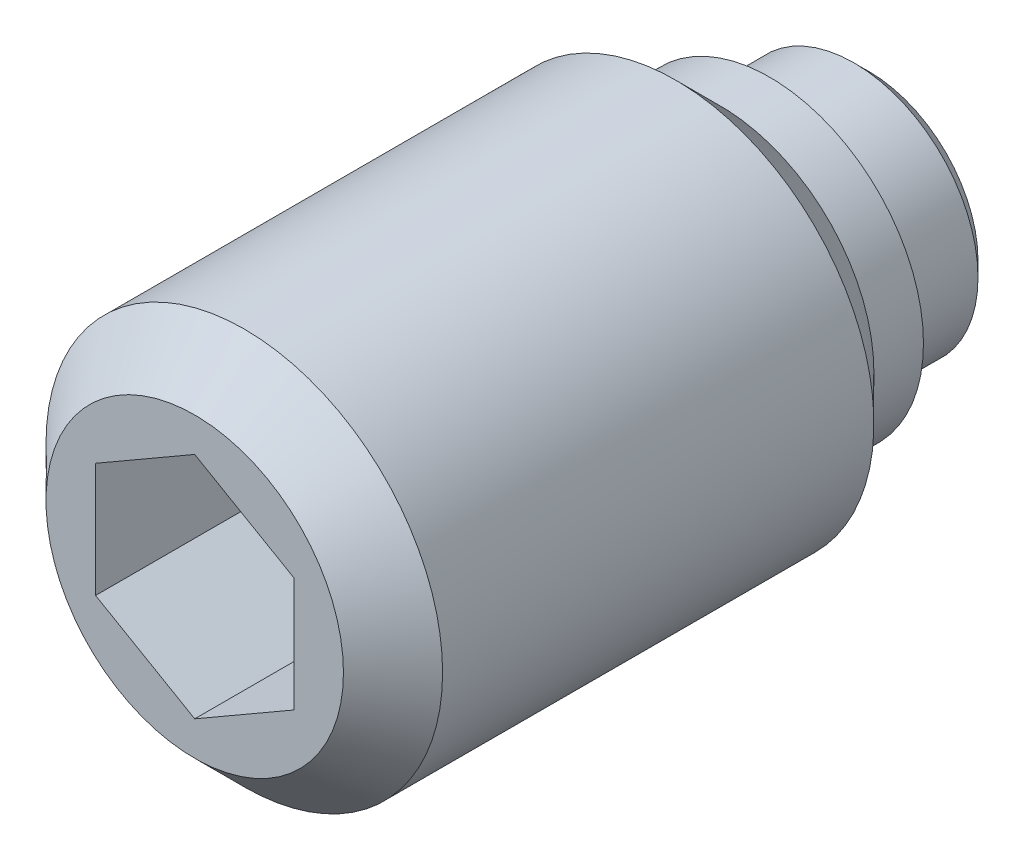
ISO-10303-21;
HEADER;
FILE_DESCRIPTION(('STEP AP214'),'2;1');
FILE_NAME('part.step','',(''),(''),'','','');
FILE_SCHEMA(('AUTOMOTIVE_DESIGN { 1 0 10303 214 1 1 1 1 }'));
ENDSEC;
DATA;
#1=APPLICATION_CONTEXT('core data for automotive mechanical design processes');
#2=APPLICATION_PROTOCOL_DEFINITION('international standard','automotive_design',2000,#1);
#3=PRODUCT_CONTEXT('',#1,'mechanical');
#4=PRODUCT('Part','Part','',(#3));
#5=PRODUCT_RELATED_PRODUCT_CATEGORY('part','',(#4));
#6=PRODUCT_DEFINITION_FORMATION('','',#4);
#7=PRODUCT_DEFINITION_CONTEXT('part definition',#1,'design');
#8=PRODUCT_DEFINITION('design','',#6,#7);
#9=PRODUCT_DEFINITION_SHAPE('','',#8);
#10=(LENGTH_UNIT() NAMED_UNIT(*) SI_UNIT(.MILLI.,.METRE.));
#11=(NAMED_UNIT(*) PLANE_ANGLE_UNIT() SI_UNIT($,.RADIAN.));
#12=(NAMED_UNIT(*) SI_UNIT($,.STERADIAN.) SOLID_ANGLE_UNIT());
#13=UNCERTAINTY_MEASURE_WITH_UNIT(LENGTH_MEASURE(1.E-05),#10,'distance_accuracy_value','');
#14=(GEOMETRIC_REPRESENTATION_CONTEXT(3) GLOBAL_UNCERTAINTY_ASSIGNED_CONTEXT((#13)) GLOBAL_UNIT_ASSIGNED_CONTEXT((#10,
#11,#12)) REPRESENTATION_CONTEXT('',''));
#15=CARTESIAN_POINT('',(0.,0.,0.));
#16=DIRECTION('',(0.,0.,1.));
#17=DIRECTION('',(1.,0.,0.));
#18=AXIS2_PLACEMENT_3D('',#15,#16,#17);
#19=CARTESIAN_POINT('',(0.,0.,0.));
#20=DIRECTION('',(0.,0.,-1.));
#21=DIRECTION('',(-1.,0.,0.));
#22=AXIS2_PLACEMENT_3D('',#19,#20,#21);
#23=CYLINDRICAL_SURFACE('',#22,2.5);
#24=CARTESIAN_POINT('',(0.,0.,0.3));
#25=DIRECTION('',(0.,0.,-1.));
#26=DIRECTION('',(-1.,0.,0.));
#27=AXIS2_PLACEMENT_3D('',#24,#25,#26);
#28=CIRCLE('',#27,2.5);
#29=CARTESIAN_POINT('',(-2.5,0.,0.3));
#30=VERTEX_POINT('',#29);
#31=EDGE_CURVE('E133',#30,#30,#28,.T.);
#32=ORIENTED_EDGE('',*,*,#31,.F.);
#33=EDGE_LOOP('',(#32));
#34=FACE_BOUND('',#33,.T.);
#35=CARTESIAN_POINT('',(0.,0.,2.));
#36=DIRECTION('',(0.,0.,-1.));
#37=DIRECTION('',(-1.,0.,0.));
#38=AXIS2_PLACEMENT_3D('',#35,#36,#37);
#39=CIRCLE('',#38,2.5);
#40=CARTESIAN_POINT('',(-2.5,0.,2.));
#41=VERTEX_POINT('',#40);
#42=EDGE_CURVE('E127',#41,#41,#39,.T.);
#43=ORIENTED_EDGE('',*,*,#42,.T.);
#44=EDGE_LOOP('',(#43));
#45=FACE_BOUND('',#44,.T.);
#46=ADVANCED_FACE('F14',(#34,#45),#23,.T.);
#47=CARTESIAN_POINT('',(0.,0.,0.3));
#48=DIRECTION('',(0.,0.,1.));
#49=DIRECTION('',(1.,0.,0.));
#50=AXIS2_PLACEMENT_3D('',#47,#48,#49);
#51=CONICAL_SURFACE('',#50,2.5,0.785398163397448);
#52=CARTESIAN_POINT('',(0.,0.,0.));
#53=DIRECTION('',(0.,0.,-1.));
#54=DIRECTION('',(-1.,0.,0.));
#55=AXIS2_PLACEMENT_3D('',#52,#53,#54);
#56=CIRCLE('',#55,2.2);
#57=CARTESIAN_POINT('',(-2.2,0.,0.));
#58=VERTEX_POINT('',#57);
#59=EDGE_CURVE('E130',#58,#58,#56,.T.);
#60=ORIENTED_EDGE('',*,*,#59,.F.);
#61=EDGE_LOOP('',(#60));
#62=FACE_BOUND('',#61,.T.);
#63=ORIENTED_EDGE('',*,*,#31,.T.);
#64=EDGE_LOOP('',(#63));
#65=FACE_BOUND('',#64,.T.);
#66=ADVANCED_FACE('F159',(#62,#65),#51,.T.);
#67=CARTESIAN_POINT('',(0.,2.2,0.));
#68=DIRECTION('',(0.,0.,1.));
#69=DIRECTION('',(1.,0.,0.));
#70=AXIS2_PLACEMENT_3D('',#67,#68,#69);
#71=PLANE('',#70);
#72=ORIENTED_EDGE('',*,*,#59,.T.);
#73=EDGE_LOOP('',(#72));
#74=FACE_BOUND('',#73,.T.);
#75=ADVANCED_FACE('F165',(#74),#71,.F.);
#76=CARTESIAN_POINT('',(0.,0.,2.));
#77=DIRECTION('',(0.,0.,-1.));
#78=DIRECTION('',(-1.,0.,0.));
#79=AXIS2_PLACEMENT_3D('',#76,#77,#78);
#80=CYLINDRICAL_SURFACE('',#79,4.);
#81=CARTESIAN_POINT('',(0.,0.,3.9));
#82=DIRECTION('',(0.,0.,-1.));
#83=DIRECTION('',(-1.,0.,0.));
#84=AXIS2_PLACEMENT_3D('',#81,#82,#83);
#85=CIRCLE('',#84,4.);
#86=CARTESIAN_POINT('',(-4.,0.,3.9));
#87=VERTEX_POINT('',#86);
#88=EDGE_CURVE('E9',#87,#87,#85,.T.);
#89=ORIENTED_EDGE('',*,*,#88,.F.);
#90=EDGE_LOOP('',(#89));
#91=FACE_BOUND('',#90,.T.);
#92=CARTESIAN_POINT('',(0.,0.,12.6));
#93=DIRECTION('',(0.,0.,1.));
#94=DIRECTION('',(1.,0.,0.));
#95=AXIS2_PLACEMENT_3D('',#92,#93,#94);
#96=CIRCLE('',#95,4.);
#97=CARTESIAN_POINT('',(4.,0.,12.6));
#98=VERTEX_POINT('',#97);
#99=EDGE_CURVE('E124',#98,#98,#96,.T.);
#100=ORIENTED_EDGE('',*,*,#99,.F.);
#101=EDGE_LOOP('',(#100));
#102=FACE_BOUND('',#101,.T.);
#103=ADVANCED_FACE('F16',(#91,#102),#80,.T.);
#104=CARTESIAN_POINT('',(0.,3.1,2.));
#105=DIRECTION('',(0.,0.,1.));
#106=DIRECTION('',(1.,0.,0.));
#107=AXIS2_PLACEMENT_3D('',#104,#105,#106);
#108=PLANE('',#107);
#109=CARTESIAN_POINT('',(0.,0.,2.));
#110=DIRECTION('',(0.,0.,-1.));
#111=DIRECTION('',(-1.,0.,0.));
#112=AXIS2_PLACEMENT_3D('',#109,#110,#111);
#113=CIRCLE('',#112,3.1);
#114=CARTESIAN_POINT('',(-3.1,0.,2.));
#115=VERTEX_POINT('',#114);
#116=EDGE_CURVE('E136',#115,#115,#113,.T.);
#117=ORIENTED_EDGE('',*,*,#116,.T.);
#118=EDGE_LOOP('',(#117));
#119=FACE_BOUND('',#118,.T.);
#120=ORIENTED_EDGE('',*,*,#42,.F.);
#121=EDGE_LOOP('',(#120));
#122=FACE_BOUND('',#121,.T.);
#123=ADVANCED_FACE('F156',(#119,#122),#108,.F.);
#124=CARTESIAN_POINT('',(0.,0.,2.));
#125=DIRECTION('',(0.,0.,-1.));
#126=DIRECTION('',(-1.,0.,0.));
#127=AXIS2_PLACEMENT_3D('',#124,#125,#126);
#128=CYLINDRICAL_SURFACE('',#127,3.1);
#129=CARTESIAN_POINT('',(0.,0.,3.));
#130=DIRECTION('',(0.,0.,-1.));
#131=DIRECTION('',(-1.,0.,0.));
#132=AXIS2_PLACEMENT_3D('',#129,#130,#131);
#133=CIRCLE('',#132,3.1);
#134=CARTESIAN_POINT('',(-3.1,0.,3.));
#135=VERTEX_POINT('',#134);
#136=EDGE_CURVE('E22',#135,#135,#133,.T.);
#137=ORIENTED_EDGE('',*,*,#136,.T.);
#138=EDGE_LOOP('',(#137));
#139=FACE_BOUND('',#138,.T.);
#140=ORIENTED_EDGE('',*,*,#116,.F.);
#141=EDGE_LOOP('',(#140));
#142=FACE_BOUND('',#141,.T.);
#143=ADVANCED_FACE('F141',(#139,#142),#128,.T.);
#144=CARTESIAN_POINT('',(0.,0.,3.9));
#145=DIRECTION('',(0.,0.,1.));
#146=DIRECTION('',(1.,0.,0.));
#147=AXIS2_PLACEMENT_3D('',#144,#145,#146);
#148=CONICAL_SURFACE('',#147,4.,0.78539816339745);
#149=ORIENTED_EDGE('',*,*,#88,.T.);
#150=EDGE_LOOP('',(#149));
#151=FACE_BOUND('',#150,.T.);
#152=ORIENTED_EDGE('',*,*,#136,.F.);
#153=EDGE_LOOP('',(#152));
#154=FACE_BOUND('',#153,.T.);
#155=ADVANCED_FACE('F144',(#151,#154),#148,.T.);
#156=CARTESIAN_POINT('',(0.,-3.,13.6));
#157=DIRECTION('',(0.,0.,1.));
#158=DIRECTION('',(1.,0.,0.));
#159=AXIS2_PLACEMENT_3D('',#156,#157,#158);
#160=PLANE('',#159);
#161=DIRECTION('',(0.866025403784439,-0.5,0.));
#162=VECTOR('',#161,1.);
#163=CARTESIAN_POINT('',(-2.,-1.15470053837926,13.6));
#164=LINE('',#163,#162);
#165=CARTESIAN_POINT('',(-2.,-1.15470053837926,13.6));
#166=VERTEX_POINT('',#165);
#167=CARTESIAN_POINT('',(0.,-2.30940107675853,13.6));
#168=VERTEX_POINT('',#167);
#169=EDGE_CURVE('E29',#166,#168,#164,.T.);
#170=ORIENTED_EDGE('',*,*,#169,.F.);
#171=DIRECTION('',(0.,-1.,0.));
#172=VECTOR('',#171,1.);
#173=CARTESIAN_POINT('',(-2.,1.15470053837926,13.6));
#174=LINE('',#173,#172);
#175=CARTESIAN_POINT('',(-2.,1.15470053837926,13.6));
#176=VERTEX_POINT('',#175);
#177=EDGE_CURVE('E112',#176,#166,#174,.T.);
#178=ORIENTED_EDGE('',*,*,#177,.F.);
#179=DIRECTION('',(-0.866025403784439,-0.5,0.));
#180=VECTOR('',#179,1.);
#181=CARTESIAN_POINT('',(0.,2.30940107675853,13.6));
#182=LINE('',#181,#180);
#183=CARTESIAN_POINT('',(0.,2.30940107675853,13.6));
#184=VERTEX_POINT('',#183);
#185=EDGE_CURVE('E110',#184,#176,#182,.T.);
#186=ORIENTED_EDGE('',*,*,#185,.F.);
#187=DIRECTION('',(-0.866025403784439,0.5,0.));
#188=VECTOR('',#187,1.);
#189=CARTESIAN_POINT('',(2.,1.15470053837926,13.6));
#190=LINE('',#189,#188);
#191=CARTESIAN_POINT('',(2.,1.15470053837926,13.6));
#192=VERTEX_POINT('',#191);
#193=EDGE_CURVE('E77',#192,#184,#190,.T.);
#194=ORIENTED_EDGE('',*,*,#193,.F.);
#195=DIRECTION('',(0.,1.,0.));
#196=VECTOR('',#195,1.);
#197=CARTESIAN_POINT('',(2.,-1.15470053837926,13.6));
#198=LINE('',#197,#196);
#199=CARTESIAN_POINT('',(2.,-1.15470053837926,13.6));
#200=VERTEX_POINT('',#199);
#201=EDGE_CURVE('E106',#200,#192,#198,.T.);
#202=ORIENTED_EDGE('',*,*,#201,.F.);
#203=DIRECTION('',(0.866025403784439,0.5,0.));
#204=VECTOR('',#203,1.);
#205=CARTESIAN_POINT('',(0.,-2.30940107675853,13.6));
#206=LINE('',#205,#204);
#207=EDGE_CURVE('E103',#168,#200,#206,.T.);
#208=ORIENTED_EDGE('',*,*,#207,.F.);
#209=EDGE_LOOP('',(#170,#178,#186,#194,#202,#208));
#210=FACE_BOUND('',#209,.T.);
#211=CARTESIAN_POINT('',(0.,0.,13.6));
#212=DIRECTION('',(0.,0.,1.));
#213=DIRECTION('',(1.,0.,0.));
#214=AXIS2_PLACEMENT_3D('',#211,#212,#213);
#215=CIRCLE('',#214,3.);
#216=CARTESIAN_POINT('',(3.,0.,13.6));
#217=VERTEX_POINT('',#216);
#218=EDGE_CURVE('E116',#217,#217,#215,.T.);
#219=ORIENTED_EDGE('',*,*,#218,.T.);
#220=EDGE_LOOP('',(#219));
#221=FACE_BOUND('',#220,.T.);
#222=ADVANCED_FACE('F146',(#210,#221),#160,.T.);
#223=CARTESIAN_POINT('',(0.,0.,13.6));
#224=DIRECTION('',(0.,0.,-1.));
#225=DIRECTION('',(-1.,0.,0.));
#226=AXIS2_PLACEMENT_3D('',#223,#224,#225);
#227=CONICAL_SURFACE('',#226,3.,0.785398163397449);
#228=ORIENTED_EDGE('',*,*,#99,.T.);
#229=EDGE_LOOP('',(#228));
#230=FACE_BOUND('',#229,.T.);
#231=ORIENTED_EDGE('',*,*,#218,.F.);
#232=EDGE_LOOP('',(#231));
#233=FACE_BOUND('',#232,.T.);
#234=ADVANCED_FACE('F153',(#230,#233),#227,.T.);
#235=CARTESIAN_POINT('',(-2.,-1.15470053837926,9.6));
#236=DIRECTION('',(-0.5,-0.866025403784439,0.));
#237=DIRECTION('',(0.866025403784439,-0.5,0.));
#238=AXIS2_PLACEMENT_3D('',#235,#236,#237);
#239=PLANE('',#238);
#240=ORIENTED_EDGE('',*,*,#169,.T.);
#241=DIRECTION('',(0.,0.,1.));
#242=VECTOR('',#241,1.);
#243=CARTESIAN_POINT('',(0.,-2.30940107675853,9.6));
#244=LINE('',#243,#242);
#245=CARTESIAN_POINT('',(0.,-2.30940107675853,9.6));
#246=VERTEX_POINT('',#245);
#247=EDGE_CURVE('E59',#246,#168,#244,.T.);
#248=ORIENTED_EDGE('',*,*,#247,.F.);
#249=DIRECTION('',(0.866025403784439,-0.5,0.));
#250=VECTOR('',#249,1.);
#251=CARTESIAN_POINT('',(-2.,-1.15470053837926,9.6));
#252=LINE('',#251,#250);
#253=CARTESIAN_POINT('',(-2.,-1.15470053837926,9.6));
#254=VERTEX_POINT('',#253);
#255=EDGE_CURVE('E114',#254,#246,#252,.T.);
#256=ORIENTED_EDGE('',*,*,#255,.F.);
#257=DIRECTION('',(0.,0.,1.));
#258=VECTOR('',#257,1.);
#259=CARTESIAN_POINT('',(-2.,-1.15470053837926,9.6));
#260=LINE('',#259,#258);
#261=EDGE_CURVE('E37',#254,#166,#260,.T.);
#262=ORIENTED_EDGE('',*,*,#261,.T.);
#263=EDGE_LOOP('',(#240,#248,#256,#262));
#264=FACE_BOUND('',#263,.T.);
#265=ADVANCED_FACE('F191',(#264),#239,.F.);
#266=CARTESIAN_POINT('',(-2.,1.15470053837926,9.6));
#267=DIRECTION('',(-1.,0.,0.));
#268=DIRECTION('',(0.,0.,1.));
#269=AXIS2_PLACEMENT_3D('',#266,#267,#268);
#270=PLANE('',#269);
#271=ORIENTED_EDGE('',*,*,#177,.T.);
#272=ORIENTED_EDGE('',*,*,#261,.F.);
#273=DIRECTION('',(0.,-1.,0.));
#274=VECTOR('',#273,1.);
#275=CARTESIAN_POINT('',(-2.,1.15470053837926,9.6));
#276=LINE('',#275,#274);
#277=CARTESIAN_POINT('',(-2.,1.15470053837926,9.6));
#278=VERTEX_POINT('',#277);
#279=EDGE_CURVE('E89',#278,#254,#276,.T.);
#280=ORIENTED_EDGE('',*,*,#279,.F.);
#281=DIRECTION('',(0.,0.,1.));
#282=VECTOR('',#281,1.);
#283=CARTESIAN_POINT('',(-2.,1.15470053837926,9.6));
#284=LINE('',#283,#282);
#285=EDGE_CURVE('E81',#278,#176,#284,.T.);
#286=ORIENTED_EDGE('',*,*,#285,.T.);
#287=EDGE_LOOP('',(#271,#272,#280,#286));
#288=FACE_BOUND('',#287,.T.);
#289=ADVANCED_FACE('F198',(#288),#270,.F.);
#290=CARTESIAN_POINT('',(0.,2.30940107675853,9.6));
#291=DIRECTION('',(-0.5,0.866025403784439,0.));
#292=DIRECTION('',(-0.866025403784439,-0.5,0.));
#293=AXIS2_PLACEMENT_3D('',#290,#291,#292);
#294=PLANE('',#293);
#295=ORIENTED_EDGE('',*,*,#185,.T.);
#296=ORIENTED_EDGE('',*,*,#285,.F.);
#297=DIRECTION('',(-0.866025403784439,-0.5,0.));
#298=VECTOR('',#297,1.);
#299=CARTESIAN_POINT('',(0.,2.30940107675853,9.6));
#300=LINE('',#299,#298);
#301=CARTESIAN_POINT('',(0.,2.30940107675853,9.6));
#302=VERTEX_POINT('',#301);
#303=EDGE_CURVE('E85',#302,#278,#300,.T.);
#304=ORIENTED_EDGE('',*,*,#303,.F.);
#305=DIRECTION('',(0.,0.,1.));
#306=VECTOR('',#305,1.);
#307=CARTESIAN_POINT('',(0.,2.30940107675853,9.6));
#308=LINE('',#307,#306);
#309=EDGE_CURVE('E70',#302,#184,#308,.T.);
#310=ORIENTED_EDGE('',*,*,#309,.T.);
#311=EDGE_LOOP('',(#295,#296,#304,#310));
#312=FACE_BOUND('',#311,.T.);
#313=ADVANCED_FACE('F86',(#312),#294,.F.);
#314=CARTESIAN_POINT('',(2.,1.15470053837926,9.6));
#315=DIRECTION('',(0.5,0.866025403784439,0.));
#316=DIRECTION('',(-0.866025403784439,0.5,0.));
#317=AXIS2_PLACEMENT_3D('',#314,#315,#316);
#318=PLANE('',#317);
#319=ORIENTED_EDGE('',*,*,#193,.T.);
#320=ORIENTED_EDGE('',*,*,#309,.F.);
#321=DIRECTION('',(-0.866025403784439,0.5,0.));
#322=VECTOR('',#321,1.);
#323=CARTESIAN_POINT('',(2.,1.15470053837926,9.6));
#324=LINE('',#323,#322);
#325=CARTESIAN_POINT('',(2.,1.15470053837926,9.6));
#326=VERTEX_POINT('',#325);
#327=EDGE_CURVE('E74',#326,#302,#324,.T.);
#328=ORIENTED_EDGE('',*,*,#327,.F.);
#329=DIRECTION('',(0.,0.,1.));
#330=VECTOR('',#329,1.);
#331=CARTESIAN_POINT('',(2.,1.15470053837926,9.6));
#332=LINE('',#331,#330);
#333=EDGE_CURVE('E82',#326,#192,#332,.T.);
#334=ORIENTED_EDGE('',*,*,#333,.T.);
#335=EDGE_LOOP('',(#319,#320,#328,#334));
#336=FACE_BOUND('',#335,.T.);
#337=ADVANCED_FACE('F72',(#336),#318,.F.);
#338=CARTESIAN_POINT('',(2.,-1.15470053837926,9.6));
#339=DIRECTION('',(1.,0.,0.));
#340=DIRECTION('',(0.,0.,-1.));
#341=AXIS2_PLACEMENT_3D('',#338,#339,#340);
#342=PLANE('',#341);
#343=ORIENTED_EDGE('',*,*,#201,.T.);
#344=ORIENTED_EDGE('',*,*,#333,.F.);
#345=DIRECTION('',(0.,1.,0.));
#346=VECTOR('',#345,1.);
#347=CARTESIAN_POINT('',(2.,-1.15470053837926,9.6));
#348=LINE('',#347,#346);
#349=CARTESIAN_POINT('',(2.,-1.15470053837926,9.6));
#350=VERTEX_POINT('',#349);
#351=EDGE_CURVE('E95',#350,#326,#348,.T.);
#352=ORIENTED_EDGE('',*,*,#351,.F.);
#353=DIRECTION('',(0.,0.,1.));
#354=VECTOR('',#353,1.);
#355=CARTESIAN_POINT('',(2.,-1.15470053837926,9.6));
#356=LINE('',#355,#354);
#357=EDGE_CURVE('E119',#350,#200,#356,.T.);
#358=ORIENTED_EDGE('',*,*,#357,.T.);
#359=EDGE_LOOP('',(#343,#344,#352,#358));
#360=FACE_BOUND('',#359,.T.);
#361=ADVANCED_FACE('F204',(#360),#342,.F.);
#362=CARTESIAN_POINT('',(0.,-2.30940107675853,9.6));
#363=DIRECTION('',(0.5,-0.866025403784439,0.));
#364=DIRECTION('',(0.866025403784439,0.5,0.));
#365=AXIS2_PLACEMENT_3D('',#362,#363,#364);
#366=PLANE('',#365);
#367=ORIENTED_EDGE('',*,*,#207,.T.);
#368=ORIENTED_EDGE('',*,*,#357,.F.);
#369=DIRECTION('',(0.866025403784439,0.5,0.));
#370=VECTOR('',#369,1.);
#371=CARTESIAN_POINT('',(0.,-2.30940107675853,9.6));
#372=LINE('',#371,#370);
#373=EDGE_CURVE('E97',#246,#350,#372,.T.);
#374=ORIENTED_EDGE('',*,*,#373,.F.);
#375=ORIENTED_EDGE('',*,*,#247,.T.);
#376=EDGE_LOOP('',(#367,#368,#374,#375));
#377=FACE_BOUND('',#376,.T.);
#378=ADVANCED_FACE('F201',(#377),#366,.F.);
#379=CARTESIAN_POINT('',(0.,0.,9.6));
#380=DIRECTION('',(0.,0.,1.));
#381=DIRECTION('',(1.,0.,0.));
#382=AXIS2_PLACEMENT_3D('',#379,#380,#381);
#383=PLANE('',#382);
#384=ORIENTED_EDGE('',*,*,#255,.T.);
#385=ORIENTED_EDGE('',*,*,#373,.T.);
#386=ORIENTED_EDGE('',*,*,#351,.T.);
#387=ORIENTED_EDGE('',*,*,#327,.T.);
#388=ORIENTED_EDGE('',*,*,#303,.T.);
#389=ORIENTED_EDGE('',*,*,#279,.T.);
#390=EDGE_LOOP('',(#384,#385,#386,#387,#388,#389));
#391=FACE_BOUND('',#390,.T.);
#392=ADVANCED_FACE('F92',(#391),#383,.T.);
#393=CLOSED_SHELL('',(#46,#66,#75,#103,#123,#143,#155,#222,#234,#265,#289,#313,#337,#361,#378,#392));
#394=MANIFOLD_SOLID_BREP('B1',#393);
#395=ADVANCED_BREP_SHAPE_REPRESENTATION('',(#18,#394),#14);
#396=SHAPE_DEFINITION_REPRESENTATION(#9,#395);
ENDSEC;
END-ISO-10303-21;
